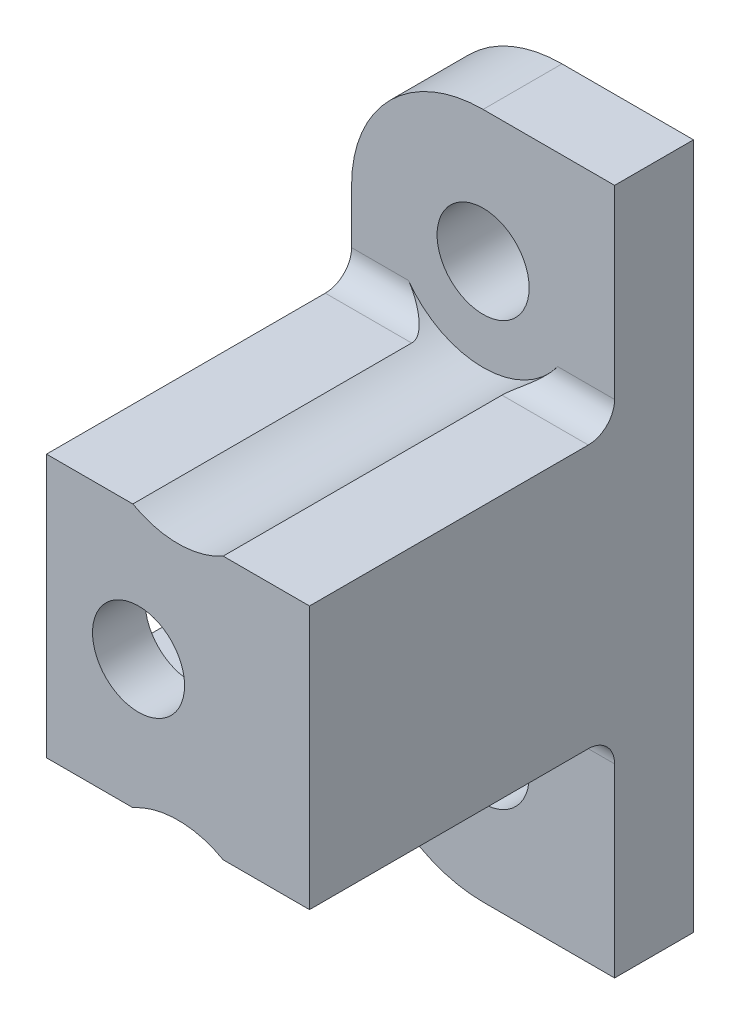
from build123d import *

# Parameters (mm, degrees)
SKETCH1_W           = 10
SKETCH1_H           = 26.1
SKETCH1_R           = 1.75
BOSS_EXTRUDE1_DEPTH = 3
FILLET1_R           = 5
SKETCH2_W           = 10
SKETCH2_H           = 10
SKETCH2_W_2         = 5.6
SKETCH2_H_2         = 5.6
EXTRUDE_THIN1_DEPTH = 11.6
FILLET3_R           = 1
FILLET4_R           = 1
SKETCH10_W          = 10
SKETCH10_H          = 10
BOSS_EXTRUDE4_DEPTH = 7
SKETCH12_W          = 6.9
SKETCH12_H          = 5.8
CUT_EXTRUDE5_DEPTH  = 2.8
CUT_EXTRUDE3_START  = -11.6
SKETCH8_R           = 3.5
CUT_EXTRUDE3_DEPTH  = 11.6
SKETCH13_R          = 1.75
CUT_EXTRUDE6_DEPTH  = 17.8


with BuildPart() as part:
    # Sketch1 → Boss-Extrude1 (new body)
    with BuildSketch(Plane.XY):
        with Locations((-0.598290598, 2.536730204)):
            Rectangle(SKETCH1_W, SKETCH1_H)
        with Locations((-0.598290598, 10.586730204)):
            Circle(SKETCH1_R, mode=Mode.SUBTRACT)
        with Locations((-0.598290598, -5.513269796)):
            Circle(SKETCH1_R, mode=Mode.SUBTRACT)
    extrude(amount=BOSS_EXTRUDE1_DEPTH)

    # Fillet1
    fillet1_edges = [part.edges().sort_by_distance(p)[0] for p in [
        (-5.598290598, 15.586730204, 1.5),
        (-5.598290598, -10.513269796, 1.5),
    ]]
    fillet(fillet1_edges, radius=FILLET1_R)

    # Sketch2 → Extrude-Thin1 (add)
    with BuildSketch(Plane.XY.offset(3)):
        with Locations((-0.598290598, 2.536730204)):
            Rectangle(SKETCH2_W, SKETCH2_H)
        with Locations((-0.598290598, 2.536730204)):
            Rectangle(SKETCH2_W_2, SKETCH2_H_2, mode=Mode.SUBTRACT)
    extrude(amount=EXTRUDE_THIN1_DEPTH)

    # Fillet3
    fillet3_edges = [part.edges().sort_by_distance(p)[0] for p in [
        (-3.398290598, 2.536730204, 3),
        (-0.598290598, -0.263269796, 3),
        (2.201709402, 2.536730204, 3),
        (-0.598290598, 5.336730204, 3),
        (-3.398290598, -0.263269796, 8.8),
        (2.201709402, -0.263269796, 8.8),
        (2.201709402, 5.336730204, 8.8),
        (-3.398290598, 5.336730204, 8.8),
    ]]
    fillet(fillet3_edges, radius=FILLET3_R)

    # Fillet4
    fillet4_edges = [part.edges().sort_by_distance(p)[0] for p in [
        (-0.598290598, -2.463269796, 3),
        (-0.598290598, 7.536730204, 3),
    ]]
    fillet(fillet4_edges, radius=FILLET4_R)

    # Sketch10 → Boss-Extrude4 (add)
    with BuildSketch(Plane.XY.offset(14.6)):
        with Locations((-0.598290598, 2.536730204)):
            Rectangle(SKETCH10_W, SKETCH10_H)
    extrude(amount=-BOSS_EXTRUDE4_DEPTH)

    # Sketch12 → Cut-Extrude5 (cut)
    with BuildSketch(Plane.XY.offset(12.6)):
        with Locations((-2.148290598, 2.536730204)):
            Rectangle(SKETCH12_W, SKETCH12_H)
    extrude(amount=-CUT_EXTRUDE5_DEPTH, mode=Mode.SUBTRACT)

    # Sketch8 → Cut-Extrude3 (cut)
    with BuildSketch(Plane.XY.offset(14.6).offset(CUT_EXTRUDE3_START)):
        with Locations((-0.598290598, 10.586730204)):
            Circle(SKETCH8_R)
        with Locations((-0.598290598, -5.513269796)):
            Circle(SKETCH8_R)
    extrude(amount=CUT_EXTRUDE3_DEPTH, mode=Mode.SUBTRACT)

    # Sketch13 → Cut-Extrude6 (cut)
    with BuildSketch(Plane.XY.offset(14.6)):
        with Locations((-2.098290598, 2.536730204)):
            Circle(SKETCH13_R)
    extrude(amount=-CUT_EXTRUDE6_DEPTH, mode=Mode.SUBTRACT)


solid = part.part
